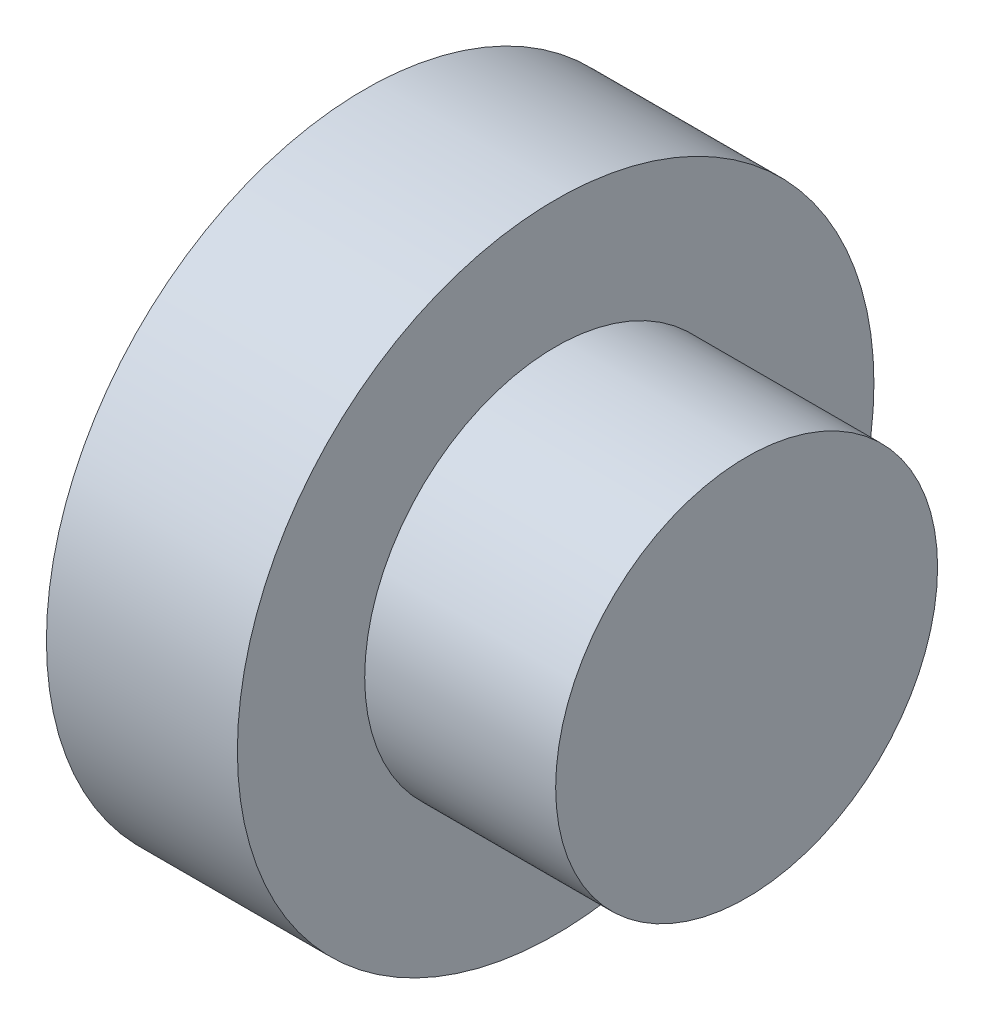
from build123d import *


with BuildPart() as part:
    # Sketch1 → Revolve1 (revolve)
    with BuildSketch(Plane(origin=(0, 0, 0), x_dir=(1, 0, 0), z_dir=(0, 1, 0)), mode=Mode.PRIVATE) as revolve1_sk:
        Polygon((0, 0), (6, 0), (6, 3), (3, 3), (3, 5), (0, 5), align=None)
    revolve(revolve1_sk.sketch.rotate(Axis((0, 0, 0), (1, 0, 0)), 180), axis=Axis((0, 0, 0), (1, 0, 0)))


solid = part.part
